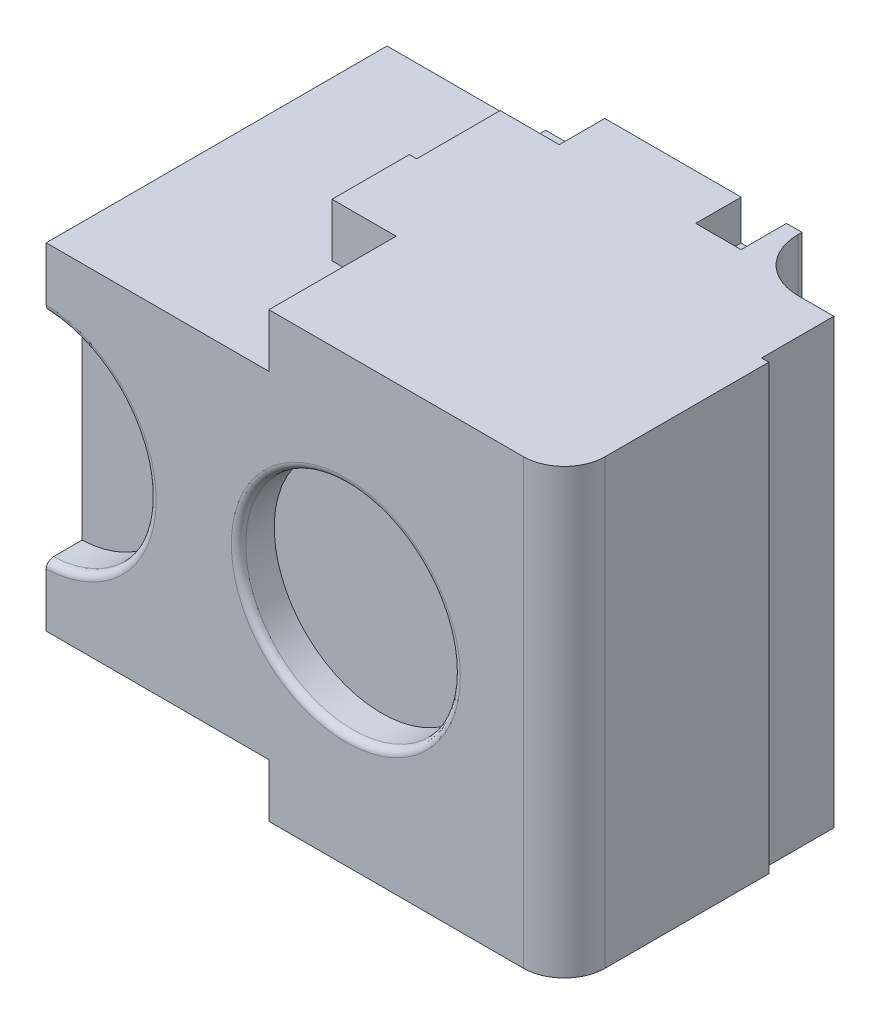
ISO-10303-21;
HEADER;
FILE_DESCRIPTION(('STEP AP214'),'2;1');
FILE_NAME('part.step','',(''),(''),'','','');
FILE_SCHEMA(('AUTOMOTIVE_DESIGN { 1 0 10303 214 1 1 1 1 }'));
ENDSEC;
DATA;
#1=APPLICATION_CONTEXT('core data for automotive mechanical design processes');
#2=APPLICATION_PROTOCOL_DEFINITION('international standard','automotive_design',2000,#1);
#3=PRODUCT_CONTEXT('',#1,'mechanical');
#4=PRODUCT('Part','Part','',(#3));
#5=PRODUCT_RELATED_PRODUCT_CATEGORY('part','',(#4));
#6=PRODUCT_DEFINITION_FORMATION('','',#4);
#7=PRODUCT_DEFINITION_CONTEXT('part definition',#1,'design');
#8=PRODUCT_DEFINITION('design','',#6,#7);
#9=PRODUCT_DEFINITION_SHAPE('','',#8);
#10=(LENGTH_UNIT() NAMED_UNIT(*) SI_UNIT(.MILLI.,.METRE.));
#11=(NAMED_UNIT(*) PLANE_ANGLE_UNIT() SI_UNIT($,.RADIAN.));
#12=(NAMED_UNIT(*) SI_UNIT($,.STERADIAN.) SOLID_ANGLE_UNIT());
#13=UNCERTAINTY_MEASURE_WITH_UNIT(LENGTH_MEASURE(1.E-05),#10,'distance_accuracy_value','');
#14=(GEOMETRIC_REPRESENTATION_CONTEXT(3) GLOBAL_UNCERTAINTY_ASSIGNED_CONTEXT((#13)) GLOBAL_UNIT_ASSIGNED_CONTEXT((#10,
#11,#12)) REPRESENTATION_CONTEXT('',''));
#15=CARTESIAN_POINT('',(0.,0.,0.));
#16=DIRECTION('',(0.,0.,1.));
#17=DIRECTION('',(1.,0.,0.));
#18=AXIS2_PLACEMENT_3D('',#15,#16,#17);
#19=CARTESIAN_POINT('',(114.935,50.8,52.832));
#20=DIRECTION('',(0.,-1.,0.));
#21=DIRECTION('',(0.,0.,-1.));
#22=AXIS2_PLACEMENT_3D('',#19,#20,#21);
#23=PLANE('',#22);
#24=DIRECTION('',(-1.,0.,0.));
#25=VECTOR('',#24,1.);
#26=CARTESIAN_POINT('',(0.,50.8,65.532));
#27=LINE('',#26,#25);
#28=CARTESIAN_POINT('',(114.935,50.8,65.532));
#29=VERTEX_POINT('',#28);
#30=CARTESIAN_POINT('',(102.235,50.8,65.532));
#31=VERTEX_POINT('',#30);
#32=EDGE_CURVE('E554',#29,#31,#27,.T.);
#33=ORIENTED_EDGE('',*,*,#32,.F.);
#34=DIRECTION('',(0.,0.,-1.));
#35=VECTOR('',#34,1.);
#36=CARTESIAN_POINT('',(114.935,50.8,52.832));
#37=LINE('',#36,#35);
#38=CARTESIAN_POINT('',(114.935,50.8,52.832));
#39=VERTEX_POINT('',#38);
#40=EDGE_CURVE('E560',#29,#39,#37,.T.);
#41=ORIENTED_EDGE('',*,*,#40,.T.);
#42=DIRECTION('',(1.,0.,0.));
#43=VECTOR('',#42,1.);
#44=CARTESIAN_POINT('',(45.593,50.8,52.832));
#45=LINE('',#44,#43);
#46=CARTESIAN_POINT('',(102.235,50.8,52.832));
#47=VERTEX_POINT('',#46);
#48=EDGE_CURVE('E427',#39,#47,#45,.F.);
#49=ORIENTED_EDGE('',*,*,#48,.T.);
#50=DIRECTION('',(0.,0.,1.));
#51=VECTOR('',#50,1.);
#52=CARTESIAN_POINT('',(102.235,50.8,52.832));
#53=LINE('',#52,#51);
#54=EDGE_CURVE('E552',#47,#31,#53,.T.);
#55=ORIENTED_EDGE('',*,*,#54,.T.);
#56=EDGE_LOOP('',(#33,#41,#49,#55));
#57=FACE_BOUND('',#56,.T.);
#58=ADVANCED_FACE('F35',(#57),#23,.F.);
#59=CARTESIAN_POINT('',(64.135,50.8,52.832));
#60=DIRECTION('',(0.,-1.,0.));
#61=DIRECTION('',(0.,0.,-1.));
#62=AXIS2_PLACEMENT_3D('',#59,#60,#61);
#63=PLANE('',#62);
#64=DIRECTION('',(0.,0.,-1.));
#65=VECTOR('',#64,1.);
#66=CARTESIAN_POINT('',(64.135,50.8,52.832));
#67=LINE('',#66,#65);
#68=CARTESIAN_POINT('',(64.135,50.8,65.532));
#69=VERTEX_POINT('',#68);
#70=CARTESIAN_POINT('',(64.135,50.8,52.832));
#71=VERTEX_POINT('',#70);
#72=EDGE_CURVE('E551',#69,#71,#67,.T.);
#73=ORIENTED_EDGE('',*,*,#72,.T.);
#74=DIRECTION('',(1.,0.,0.));
#75=VECTOR('',#74,1.);
#76=CARTESIAN_POINT('',(45.593,50.8,52.832));
#77=LINE('',#76,#75);
#78=CARTESIAN_POINT('',(47.625,50.8,52.832));
#79=VERTEX_POINT('',#78);
#80=EDGE_CURVE('E541',#71,#79,#77,.F.);
#81=ORIENTED_EDGE('',*,*,#80,.T.);
#82=DIRECTION('',(0.,0.,1.));
#83=VECTOR('',#82,1.);
#84=CARTESIAN_POINT('',(47.625,50.8,146.05));
#85=LINE('',#84,#83);
#86=CARTESIAN_POINT('',(47.625,50.8,65.532));
#87=VERTEX_POINT('',#86);
#88=EDGE_CURVE('E530',#87,#79,#85,.F.);
#89=ORIENTED_EDGE('',*,*,#88,.F.);
#90=DIRECTION('',(-1.,0.,0.));
#91=VECTOR('',#90,1.);
#92=CARTESIAN_POINT('',(0.,50.8,65.532));
#93=LINE('',#92,#91);
#94=EDGE_CURVE('E660',#69,#87,#93,.T.);
#95=ORIENTED_EDGE('',*,*,#94,.F.);
#96=EDGE_LOOP('',(#73,#81,#89,#95));
#97=FACE_BOUND('',#96,.T.);
#98=ADVANCED_FACE('F870',(#97),#63,.F.);
#99=CARTESIAN_POINT('',(119.253,-61.9125,50.8));
#100=DIRECTION('',(-1.,0.,0.));
#101=DIRECTION('',(0.,0.,1.));
#102=AXIS2_PLACEMENT_3D('',#99,#100,#101);
#103=PLANE('',#102);
#104=DIRECTION('',(0.,1.,0.));
#105=VECTOR('',#104,1.);
#106=CARTESIAN_POINT('',(119.253,-74.295,52.832));
#107=LINE('',#106,#105);
#108=CARTESIAN_POINT('',(119.253,-61.9125,52.832));
#109=VERTEX_POINT('',#108);
#110=CARTESIAN_POINT('',(119.253,61.9125,52.832));
#111=VERTEX_POINT('',#110);
#112=EDGE_CURVE('E432',#109,#111,#107,.T.);
#113=ORIENTED_EDGE('',*,*,#112,.T.);
#114=DIRECTION('',(0.,0.,1.));
#115=VECTOR('',#114,1.);
#116=CARTESIAN_POINT('',(119.253,61.9125,50.8));
#117=LINE('',#116,#115);
#118=CARTESIAN_POINT('',(119.253,61.9125,53.975));
#119=VERTEX_POINT('',#118);
#120=EDGE_CURVE('E608',#119,#111,#117,.F.);
#121=ORIENTED_EDGE('',*,*,#120,.F.);
#122=DIRECTION('',(0.,-1.,0.));
#123=VECTOR('',#122,1.);
#124=CARTESIAN_POINT('',(119.253,223.33077,53.975));
#125=LINE('',#124,#123);
#126=CARTESIAN_POINT('',(119.253,-61.9125,53.975));
#127=VERTEX_POINT('',#126);
#128=EDGE_CURVE('E420',#119,#127,#125,.T.);
#129=ORIENTED_EDGE('',*,*,#128,.T.);
#130=DIRECTION('',(0.,0.,1.));
#131=VECTOR('',#130,1.);
#132=CARTESIAN_POINT('',(119.253,-61.9125,50.8));
#133=LINE('',#132,#131);
#134=EDGE_CURVE('E562',#109,#127,#133,.T.);
#135=ORIENTED_EDGE('',*,*,#134,.F.);
#136=EDGE_LOOP('',(#113,#121,#129,#135));
#137=FACE_BOUND('',#136,.T.);
#138=ADVANCED_FACE('F866',(#137),#103,.F.);
#139=CARTESIAN_POINT('',(45.593,-50.8,52.832));
#140=DIRECTION('',(0.,1.,0.));
#141=DIRECTION('',(0.,0.,1.));
#142=AXIS2_PLACEMENT_3D('',#139,#140,#141);
#143=PLANE('',#142);
#144=DIRECTION('',(0.,0.,-1.));
#145=VECTOR('',#144,1.);
#146=CARTESIAN_POINT('',(114.935,-50.8,52.832));
#147=LINE('',#146,#145);
#148=CARTESIAN_POINT('',(114.935,-50.8,52.832));
#149=VERTEX_POINT('',#148);
#150=CARTESIAN_POINT('',(114.935,-50.8,65.532));
#151=VERTEX_POINT('',#150);
#152=EDGE_CURVE('E640',#149,#151,#147,.F.);
#153=ORIENTED_EDGE('',*,*,#152,.T.);
#154=DIRECTION('',(-1.,0.,0.));
#155=VECTOR('',#154,1.);
#156=CARTESIAN_POINT('',(0.,-50.8,65.532));
#157=LINE('',#156,#155);
#158=CARTESIAN_POINT('',(47.625,-50.8,65.532));
#159=VERTEX_POINT('',#158);
#160=EDGE_CURVE('E454',#159,#151,#157,.F.);
#161=ORIENTED_EDGE('',*,*,#160,.F.);
#162=DIRECTION('',(0.,0.,1.));
#163=VECTOR('',#162,1.);
#164=CARTESIAN_POINT('',(47.625,-50.8,146.05));
#165=LINE('',#164,#163);
#166=CARTESIAN_POINT('',(47.625,-50.8,52.832));
#167=VERTEX_POINT('',#166);
#168=EDGE_CURVE('E478',#167,#159,#165,.T.);
#169=ORIENTED_EDGE('',*,*,#168,.F.);
#170=DIRECTION('',(1.,0.,0.));
#171=VECTOR('',#170,1.);
#172=CARTESIAN_POINT('',(45.593,-50.8,52.832));
#173=LINE('',#172,#171);
#174=EDGE_CURVE('E584',#167,#149,#173,.T.);
#175=ORIENTED_EDGE('',*,*,#174,.T.);
#176=EDGE_LOOP('',(#153,#161,#169,#175));
#177=FACE_BOUND('',#176,.T.);
#178=ADVANCED_FACE('F862',(#177),#143,.F.);
#179=CARTESIAN_POINT('',(114.935,61.9125,52.832));
#180=DIRECTION('',(1.,0.,0.));
#181=DIRECTION('',(0.,0.,-1.));
#182=AXIS2_PLACEMENT_3D('',#179,#180,#181);
#183=PLANE('',#182);
#184=ORIENTED_EDGE('',*,*,#40,.F.);
#185=DIRECTION('',(0.,1.,0.));
#186=VECTOR('',#185,1.);
#187=CARTESIAN_POINT('',(114.935,-74.295,65.532));
#188=LINE('',#187,#186);
#189=CARTESIAN_POINT('',(114.935,61.9125,65.532));
#190=VERTEX_POINT('',#189);
#191=EDGE_CURVE('E557',#190,#29,#188,.F.);
#192=ORIENTED_EDGE('',*,*,#191,.F.);
#193=DIRECTION('',(0.,0.,1.));
#194=VECTOR('',#193,1.);
#195=CARTESIAN_POINT('',(114.935,61.9125,50.8));
#196=LINE('',#195,#194);
#197=CARTESIAN_POINT('',(114.935,61.9125,52.832));
#198=VERTEX_POINT('',#197);
#199=EDGE_CURVE('E357',#198,#190,#196,.T.);
#200=ORIENTED_EDGE('',*,*,#199,.F.);
#201=DIRECTION('',(0.,1.,0.));
#202=VECTOR('',#201,1.);
#203=CARTESIAN_POINT('',(114.935,-74.295,52.832));
#204=LINE('',#203,#202);
#205=EDGE_CURVE('E429',#198,#39,#204,.F.);
#206=ORIENTED_EDGE('',*,*,#205,.T.);
#207=EDGE_LOOP('',(#184,#192,#200,#206));
#208=FACE_BOUND('',#207,.T.);
#209=ADVANCED_FACE('F858',(#208),#183,.F.);
#210=CARTESIAN_POINT('',(0.,-74.295,65.532));
#211=DIRECTION('',(0.,0.,-1.));
#212=DIRECTION('',(-1.,0.,0.));
#213=AXIS2_PLACEMENT_3D('',#210,#211,#212);
#214=PLANE('',#213);
#215=DIRECTION('',(0.,1.,0.));
#216=VECTOR('',#215,1.);
#217=CARTESIAN_POINT('',(102.235,50.8,65.532));
#218=LINE('',#217,#216);
#219=CARTESIAN_POINT('',(102.235,61.9125,65.532));
#220=VERTEX_POINT('',#219);
#221=EDGE_CURVE('E549',#31,#220,#218,.T.);
#222=ORIENTED_EDGE('',*,*,#221,.T.);
#223=DIRECTION('',(1.,0.,0.));
#224=VECTOR('',#223,1.);
#225=CARTESIAN_POINT('',(146.05,61.9125,65.532));
#226=LINE('',#225,#224);
#227=EDGE_CURVE('E354',#190,#220,#226,.F.);
#228=ORIENTED_EDGE('',*,*,#227,.F.);
#229=ORIENTED_EDGE('',*,*,#191,.T.);
#230=ORIENTED_EDGE('',*,*,#32,.T.);
#231=EDGE_LOOP('',(#222,#228,#229,#230));
#232=FACE_BOUND('',#231,.T.);
#233=ADVANCED_FACE('F854',(#232),#214,.T.);
#234=CARTESIAN_POINT('',(102.235,50.8,52.832));
#235=DIRECTION('',(-1.,0.,0.));
#236=DIRECTION('',(0.,0.,1.));
#237=AXIS2_PLACEMENT_3D('',#234,#235,#236);
#238=PLANE('',#237);
#239=ORIENTED_EDGE('',*,*,#54,.F.);
#240=DIRECTION('',(0.,1.,0.));
#241=VECTOR('',#240,1.);
#242=CARTESIAN_POINT('',(102.235,-74.295,52.832));
#243=LINE('',#242,#241);
#244=CARTESIAN_POINT('',(102.235,61.9125,52.832));
#245=VERTEX_POINT('',#244);
#246=EDGE_CURVE('E424',#47,#245,#243,.T.);
#247=ORIENTED_EDGE('',*,*,#246,.T.);
#248=DIRECTION('',(0.,0.,1.));
#249=VECTOR('',#248,1.);
#250=CARTESIAN_POINT('',(102.235,61.9125,50.8));
#251=LINE('',#250,#249);
#252=EDGE_CURVE('E350',#220,#245,#251,.F.);
#253=ORIENTED_EDGE('',*,*,#252,.F.);
#254=ORIENTED_EDGE('',*,*,#221,.F.);
#255=EDGE_LOOP('',(#239,#247,#253,#254));
#256=FACE_BOUND('',#255,.T.);
#257=ADVANCED_FACE('F850',(#256),#238,.F.);
#258=CARTESIAN_POINT('',(64.135,61.9125,52.832));
#259=DIRECTION('',(1.,0.,0.));
#260=DIRECTION('',(0.,0.,-1.));
#261=AXIS2_PLACEMENT_3D('',#258,#259,#260);
#262=PLANE('',#261);
#263=ORIENTED_EDGE('',*,*,#72,.F.);
#264=DIRECTION('',(0.,1.,0.));
#265=VECTOR('',#264,1.);
#266=CARTESIAN_POINT('',(64.135,-74.295,65.532));
#267=LINE('',#266,#265);
#268=CARTESIAN_POINT('',(64.135,61.9125,65.532));
#269=VERTEX_POINT('',#268);
#270=EDGE_CURVE('E628',#269,#69,#267,.F.);
#271=ORIENTED_EDGE('',*,*,#270,.F.);
#272=DIRECTION('',(0.,0.,1.));
#273=VECTOR('',#272,1.);
#274=CARTESIAN_POINT('',(64.135,61.9125,50.8));
#275=LINE('',#274,#273);
#276=CARTESIAN_POINT('',(64.135,61.9125,52.832));
#277=VERTEX_POINT('',#276);
#278=EDGE_CURVE('E631',#277,#269,#275,.T.);
#279=ORIENTED_EDGE('',*,*,#278,.F.);
#280=DIRECTION('',(0.,1.,0.));
#281=VECTOR('',#280,1.);
#282=CARTESIAN_POINT('',(64.135,-74.295,52.832));
#283=LINE('',#282,#281);
#284=EDGE_CURVE('E426',#277,#71,#283,.F.);
#285=ORIENTED_EDGE('',*,*,#284,.T.);
#286=EDGE_LOOP('',(#263,#271,#279,#285));
#287=FACE_BOUND('',#286,.T.);
#288=ADVANCED_FACE('F846',(#287),#262,.F.);
#289=CARTESIAN_POINT('',(0.,-74.295,65.532));
#290=DIRECTION('',(0.,0.,-1.));
#291=DIRECTION('',(-1.,0.,0.));
#292=AXIS2_PLACEMENT_3D('',#289,#290,#291);
#293=PLANE('',#292);
#294=ORIENTED_EDGE('',*,*,#94,.T.);
#295=DIRECTION('',(0.,1.,0.));
#296=VECTOR('',#295,1.);
#297=CARTESIAN_POINT('',(47.625,0.,65.532));
#298=LINE('',#297,#296);
#299=CARTESIAN_POINT('',(47.625,61.9125,65.532));
#300=VERTEX_POINT('',#299);
#301=EDGE_CURVE('E617',#300,#87,#298,.F.);
#302=ORIENTED_EDGE('',*,*,#301,.F.);
#303=DIRECTION('',(1.,0.,0.));
#304=VECTOR('',#303,1.);
#305=CARTESIAN_POINT('',(146.05,61.9125,65.532));
#306=LINE('',#305,#304);
#307=EDGE_CURVE('E581',#269,#300,#306,.F.);
#308=ORIENTED_EDGE('',*,*,#307,.F.);
#309=ORIENTED_EDGE('',*,*,#270,.T.);
#310=EDGE_LOOP('',(#294,#302,#308,#309));
#311=FACE_BOUND('',#310,.T.);
#312=ADVANCED_FACE('F842',(#311),#293,.T.);
#313=CARTESIAN_POINT('',(47.625,0.,146.05));
#314=DIRECTION('',(-1.,0.,0.));
#315=DIRECTION('',(0.,0.,1.));
#316=AXIS2_PLACEMENT_3D('',#313,#314,#315);
#317=PLANE('',#316);
#318=DIRECTION('',(0.,1.,0.));
#319=VECTOR('',#318,1.);
#320=CARTESIAN_POINT('',(47.625,46.99,88.9));
#321=LINE('',#320,#319);
#322=CARTESIAN_POINT('',(47.625,46.99,88.9));
#323=VERTEX_POINT('',#322);
#324=CARTESIAN_POINT('',(47.625,61.9125,88.9));
#325=VERTEX_POINT('',#324);
#326=EDGE_CURVE('E522',#323,#325,#321,.T.);
#327=ORIENTED_EDGE('',*,*,#326,.T.);
#328=DIRECTION('',(0.,0.,1.));
#329=VECTOR('',#328,1.);
#330=CARTESIAN_POINT('',(47.625,61.9125,50.8));
#331=LINE('',#330,#329);
#332=EDGE_CURVE('E505',#300,#325,#331,.T.);
#333=ORIENTED_EDGE('',*,*,#332,.F.);
#334=ORIENTED_EDGE('',*,*,#301,.T.);
#335=ORIENTED_EDGE('',*,*,#88,.T.);
#336=DIRECTION('',(0.,1.,0.));
#337=VECTOR('',#336,1.);
#338=CARTESIAN_POINT('',(47.625,-74.295,52.832));
#339=LINE('',#338,#337);
#340=CARTESIAN_POINT('',(47.625,46.99,52.832));
#341=VERTEX_POINT('',#340);
#342=EDGE_CURVE('E468',#79,#341,#339,.F.);
#343=ORIENTED_EDGE('',*,*,#342,.T.);
#344=DIRECTION('',(0.,0.,-1.));
#345=VECTOR('',#344,1.);
#346=CARTESIAN_POINT('',(47.625,46.99,146.05));
#347=LINE('',#346,#345);
#348=EDGE_CURVE('E526',#341,#323,#347,.F.);
#349=ORIENTED_EDGE('',*,*,#348,.T.);
#350=EDGE_LOOP('',(#327,#333,#334,#335,#343,#349));
#351=FACE_BOUND('',#350,.T.);
#352=ADVANCED_FACE('F838',(#351),#317,.T.);
#353=CARTESIAN_POINT('',(45.593,46.99,88.9));
#354=DIRECTION('',(0.,0.,1.));
#355=DIRECTION('',(1.,0.,0.));
#356=AXIS2_PLACEMENT_3D('',#353,#354,#355);
#357=PLANE('',#356);
#358=DIRECTION('',(1.,0.,0.));
#359=VECTOR('',#358,1.);
#360=CARTESIAN_POINT('',(1.27,46.99,88.9));
#361=LINE('',#360,#359);
#362=CARTESIAN_POINT('',(45.593,46.99,88.9));
#363=VERTEX_POINT('',#362);
#364=EDGE_CURVE('E518',#323,#363,#361,.F.);
#365=ORIENTED_EDGE('',*,*,#364,.T.);
#366=DIRECTION('',(0.,1.,0.));
#367=VECTOR('',#366,1.);
#368=CARTESIAN_POINT('',(45.593,46.99,88.9));
#369=LINE('',#368,#367);
#370=CARTESIAN_POINT('',(45.593,61.9125,88.9));
#371=VERTEX_POINT('',#370);
#372=EDGE_CURVE('E514',#363,#371,#369,.T.);
#373=ORIENTED_EDGE('',*,*,#372,.T.);
#374=DIRECTION('',(1.,0.,0.));
#375=VECTOR('',#374,1.);
#376=CARTESIAN_POINT('',(146.05,61.9125,88.9));
#377=LINE('',#376,#375);
#378=EDGE_CURVE('E393',#325,#371,#377,.F.);
#379=ORIENTED_EDGE('',*,*,#378,.F.);
#380=ORIENTED_EDGE('',*,*,#326,.F.);
#381=EDGE_LOOP('',(#365,#373,#379,#380));
#382=FACE_BOUND('',#381,.T.);
#383=ADVANCED_FACE('F834',(#382),#357,.F.);
#384=CARTESIAN_POINT('',(45.593,46.99,146.05));
#385=DIRECTION('',(1.,0.,0.));
#386=DIRECTION('',(0.,0.,-1.));
#387=AXIS2_PLACEMENT_3D('',#384,#385,#386);
#388=PLANE('',#387);
#389=DIRECTION('',(0.,1.,0.));
#390=VECTOR('',#389,1.);
#391=CARTESIAN_POINT('',(45.593,0.,110.49));
#392=LINE('',#391,#390);
#393=CARTESIAN_POINT('',(45.593,61.9125,110.49));
#394=VERTEX_POINT('',#393);
#395=CARTESIAN_POINT('',(45.593,46.99,110.49));
#396=VERTEX_POINT('',#395);
#397=EDGE_CURVE('E455',#394,#396,#392,.F.);
#398=ORIENTED_EDGE('',*,*,#397,.F.);
#399=DIRECTION('',(0.,0.,1.));
#400=VECTOR('',#399,1.);
#401=CARTESIAN_POINT('',(45.593,61.9125,50.8));
#402=LINE('',#401,#400);
#403=EDGE_CURVE('E546',#371,#394,#402,.T.);
#404=ORIENTED_EDGE('',*,*,#403,.F.);
#405=ORIENTED_EDGE('',*,*,#372,.F.);
#406=DIRECTION('',(0.,0.,-1.));
#407=VECTOR('',#406,1.);
#408=CARTESIAN_POINT('',(45.593,46.99,146.05));
#409=LINE('',#408,#407);
#410=EDGE_CURVE('E509',#363,#396,#409,.F.);
#411=ORIENTED_EDGE('',*,*,#410,.T.);
#412=EDGE_LOOP('',(#398,#404,#405,#411));
#413=FACE_BOUND('',#412,.T.);
#414=ADVANCED_FACE('F830',(#413),#388,.F.);
#415=CARTESIAN_POINT('',(0.,0.,110.49));
#416=DIRECTION('',(0.,0.,1.));
#417=DIRECTION('',(1.,0.,0.));
#418=AXIS2_PLACEMENT_3D('',#415,#416,#417);
#419=PLANE('',#418);
#420=DIRECTION('',(0.,1.,0.));
#421=VECTOR('',#420,1.);
#422=CARTESIAN_POINT('',(63.5,46.99,110.49));
#423=LINE('',#422,#421);
#424=CARTESIAN_POINT('',(63.5,46.99,110.49));
#425=VERTEX_POINT('',#424);
#426=CARTESIAN_POINT('',(63.5,61.9125,110.49));
#427=VERTEX_POINT('',#426);
#428=EDGE_CURVE('E342',#425,#427,#423,.T.);
#429=ORIENTED_EDGE('',*,*,#428,.T.);
#430=DIRECTION('',(1.,0.,0.));
#431=VECTOR('',#430,1.);
#432=CARTESIAN_POINT('',(146.05,61.9125,110.49));
#433=LINE('',#432,#431);
#434=EDGE_CURVE('E371',#394,#427,#433,.T.);
#435=ORIENTED_EDGE('',*,*,#434,.F.);
#436=ORIENTED_EDGE('',*,*,#397,.T.);
#437=DIRECTION('',(1.,0.,0.));
#438=VECTOR('',#437,1.);
#439=CARTESIAN_POINT('',(1.27,46.99,110.49));
#440=LINE('',#439,#438);
#441=EDGE_CURVE('E331',#396,#425,#440,.T.);
#442=ORIENTED_EDGE('',*,*,#441,.T.);
#443=EDGE_LOOP('',(#429,#435,#436,#442));
#444=FACE_BOUND('',#443,.T.);
#445=ADVANCED_FACE('F826',(#444),#419,.T.);
#446=CARTESIAN_POINT('',(45.593,-74.295,50.8));
#447=DIRECTION('',(-1.,0.,0.));
#448=DIRECTION('',(0.,0.,1.));
#449=AXIS2_PLACEMENT_3D('',#446,#447,#448);
#450=PLANE('',#449);
#451=DIRECTION('',(0.,0.,-1.));
#452=VECTOR('',#451,1.);
#453=CARTESIAN_POINT('',(45.593,46.99,146.05));
#454=LINE('',#453,#452);
#455=CARTESIAN_POINT('',(45.593,46.99,50.8));
#456=VERTEX_POINT('',#455);
#457=CARTESIAN_POINT('',(45.593,46.99,52.832));
#458=VERTEX_POINT('',#457);
#459=EDGE_CURVE('E341',#456,#458,#454,.F.);
#460=ORIENTED_EDGE('',*,*,#459,.T.);
#461=DIRECTION('',(0.,1.,0.));
#462=VECTOR('',#461,1.);
#463=CARTESIAN_POINT('',(45.593,-74.295,52.832));
#464=LINE('',#463,#462);
#465=CARTESIAN_POINT('',(45.593,-46.99,52.832));
#466=VERTEX_POINT('',#465);
#467=EDGE_CURVE('E423',#458,#466,#464,.F.);
#468=ORIENTED_EDGE('',*,*,#467,.T.);
#469=DIRECTION('',(0.,0.,1.));
#470=VECTOR('',#469,1.);
#471=CARTESIAN_POINT('',(45.593,-46.99,146.05));
#472=LINE('',#471,#470);
#473=CARTESIAN_POINT('',(45.593,-46.99,50.8));
#474=VERTEX_POINT('',#473);
#475=EDGE_CURVE('E449',#466,#474,#472,.F.);
#476=ORIENTED_EDGE('',*,*,#475,.T.);
#477=DIRECTION('',(0.,1.,0.));
#478=VECTOR('',#477,1.);
#479=CARTESIAN_POINT('',(45.593,0.,50.8));
#480=LINE('',#479,#478);
#481=EDGE_CURVE('E452',#474,#456,#480,.T.);
#482=ORIENTED_EDGE('',*,*,#481,.T.);
#483=EDGE_LOOP('',(#460,#468,#476,#482));
#484=FACE_BOUND('',#483,.T.);
#485=ADVANCED_FACE('F822',(#484),#450,.F.);
#486=CARTESIAN_POINT('',(0.,0.,50.8));
#487=DIRECTION('',(0.,0.,1.));
#488=DIRECTION('',(1.,0.,0.));
#489=AXIS2_PLACEMENT_3D('',#486,#487,#488);
#490=PLANE('',#489);
#491=DIRECTION('',(0.,1.,0.));
#492=VECTOR('',#491,1.);
#493=CARTESIAN_POINT('',(1.27,61.9125,50.8));
#494=LINE('',#493,#492);
#495=CARTESIAN_POINT('',(1.27,46.99,50.8));
#496=VERTEX_POINT('',#495);
#497=CARTESIAN_POINT('',(1.27,-46.99,50.8));
#498=VERTEX_POINT('',#497);
#499=EDGE_CURVE('E320',#496,#498,#494,.F.);
#500=ORIENTED_EDGE('',*,*,#499,.F.);
#501=DIRECTION('',(1.,0.,0.));
#502=VECTOR('',#501,1.);
#503=CARTESIAN_POINT('',(1.27,46.99,50.8));
#504=LINE('',#503,#502);
#505=EDGE_CURVE('E321',#496,#456,#504,.T.);
#506=ORIENTED_EDGE('',*,*,#505,.T.);
#507=ORIENTED_EDGE('',*,*,#481,.F.);
#508=DIRECTION('',(1.,0.,0.));
#509=VECTOR('',#508,1.);
#510=CARTESIAN_POINT('',(45.593,-46.99,50.8));
#511=LINE('',#510,#509);
#512=EDGE_CURVE('E447',#474,#498,#511,.F.);
#513=ORIENTED_EDGE('',*,*,#512,.T.);
#514=EDGE_LOOP('',(#500,#506,#507,#513));
#515=FACE_BOUND('',#514,.T.);
#516=ADVANCED_FACE('F818',(#515),#490,.F.);
#517=CARTESIAN_POINT('',(0.,-74.295,65.532));
#518=DIRECTION('',(0.,0.,-1.));
#519=DIRECTION('',(-1.,0.,0.));
#520=AXIS2_PLACEMENT_3D('',#517,#518,#519);
#521=PLANE('',#520);
#522=DIRECTION('',(1.,0.,0.));
#523=VECTOR('',#522,1.);
#524=CARTESIAN_POINT('',(1.27,-61.9125,65.532));
#525=LINE('',#524,#523);
#526=CARTESIAN_POINT('',(47.625,-61.9125,65.532));
#527=VERTEX_POINT('',#526);
#528=CARTESIAN_POINT('',(114.935,-61.9125,65.532));
#529=VERTEX_POINT('',#528);
#530=EDGE_CURVE('E706',#527,#529,#525,.T.);
#531=ORIENTED_EDGE('',*,*,#530,.F.);
#532=DIRECTION('',(0.,1.,0.));
#533=VECTOR('',#532,1.);
#534=CARTESIAN_POINT('',(47.625,0.,65.532));
#535=LINE('',#534,#533);
#536=EDGE_CURVE('E394',#159,#527,#535,.F.);
#537=ORIENTED_EDGE('',*,*,#536,.F.);
#538=ORIENTED_EDGE('',*,*,#160,.T.);
#539=DIRECTION('',(0.,1.,0.));
#540=VECTOR('',#539,1.);
#541=CARTESIAN_POINT('',(114.935,-50.8,65.532));
#542=LINE('',#541,#540);
#543=EDGE_CURVE('E587',#151,#529,#542,.F.);
#544=ORIENTED_EDGE('',*,*,#543,.T.);
#545=EDGE_LOOP('',(#531,#537,#538,#544));
#546=FACE_BOUND('',#545,.T.);
#547=ADVANCED_FACE('F814',(#546),#521,.T.);
#548=CARTESIAN_POINT('',(114.935,-50.8,52.832));
#549=DIRECTION('',(1.,0.,0.));
#550=DIRECTION('',(0.,0.,-1.));
#551=AXIS2_PLACEMENT_3D('',#548,#549,#550);
#552=PLANE('',#551);
#553=ORIENTED_EDGE('',*,*,#152,.F.);
#554=DIRECTION('',(0.,1.,0.));
#555=VECTOR('',#554,1.);
#556=CARTESIAN_POINT('',(114.935,-74.295,52.832));
#557=LINE('',#556,#555);
#558=CARTESIAN_POINT('',(114.935,-61.9125,52.832));
#559=VERTEX_POINT('',#558);
#560=EDGE_CURVE('E586',#149,#559,#557,.F.);
#561=ORIENTED_EDGE('',*,*,#560,.T.);
#562=DIRECTION('',(0.,0.,-1.));
#563=VECTOR('',#562,1.);
#564=CARTESIAN_POINT('',(114.935,-61.9125,50.8));
#565=LINE('',#564,#563);
#566=EDGE_CURVE('E682',#529,#559,#565,.T.);
#567=ORIENTED_EDGE('',*,*,#566,.F.);
#568=ORIENTED_EDGE('',*,*,#543,.F.);
#569=EDGE_LOOP('',(#553,#561,#567,#568));
#570=FACE_BOUND('',#569,.T.);
#571=ADVANCED_FACE('F810',(#570),#552,.F.);
#572=CARTESIAN_POINT('',(45.593,-74.295,52.832));
#573=DIRECTION('',(0.,0.,1.));
#574=DIRECTION('',(1.,0.,0.));
#575=AXIS2_PLACEMENT_3D('',#572,#573,#574);
#576=PLANE('',#575);
#577=ORIENTED_EDGE('',*,*,#467,.F.);
#578=DIRECTION('',(1.,0.,0.));
#579=VECTOR('',#578,1.);
#580=CARTESIAN_POINT('',(1.27,46.99,52.832));
#581=LINE('',#580,#579);
#582=EDGE_CURVE('E501',#458,#341,#581,.T.);
#583=ORIENTED_EDGE('',*,*,#582,.T.);
#584=ORIENTED_EDGE('',*,*,#342,.F.);
#585=ORIENTED_EDGE('',*,*,#80,.F.);
#586=ORIENTED_EDGE('',*,*,#284,.F.);
#587=DIRECTION('',(1.,0.,0.));
#588=VECTOR('',#587,1.);
#589=CARTESIAN_POINT('',(146.05,61.9125,52.832));
#590=LINE('',#589,#588);
#591=EDGE_CURVE('E353',#245,#277,#590,.F.);
#592=ORIENTED_EDGE('',*,*,#591,.F.);
#593=ORIENTED_EDGE('',*,*,#246,.F.);
#594=ORIENTED_EDGE('',*,*,#48,.F.);
#595=ORIENTED_EDGE('',*,*,#205,.F.);
#596=DIRECTION('',(1.,0.,0.));
#597=VECTOR('',#596,1.);
#598=CARTESIAN_POINT('',(146.05,61.9125,52.832));
#599=LINE('',#598,#597);
#600=EDGE_CURVE('E360',#111,#198,#599,.F.);
#601=ORIENTED_EDGE('',*,*,#600,.F.);
#602=ORIENTED_EDGE('',*,*,#112,.F.);
#603=DIRECTION('',(1.,0.,0.));
#604=VECTOR('',#603,1.);
#605=CARTESIAN_POINT('',(1.27,-61.9125,52.832));
#606=LINE('',#605,#604);
#607=EDGE_CURVE('E678',#559,#109,#606,.T.);
#608=ORIENTED_EDGE('',*,*,#607,.F.);
#609=ORIENTED_EDGE('',*,*,#560,.F.);
#610=ORIENTED_EDGE('',*,*,#174,.F.);
#611=DIRECTION('',(0.,1.,0.));
#612=VECTOR('',#611,1.);
#613=CARTESIAN_POINT('',(47.625,0.,52.832));
#614=LINE('',#613,#612);
#615=CARTESIAN_POINT('',(47.625,-46.99,52.832));
#616=VERTEX_POINT('',#615);
#617=EDGE_CURVE('E475',#616,#167,#614,.F.);
#618=ORIENTED_EDGE('',*,*,#617,.F.);
#619=DIRECTION('',(1.,0.,0.));
#620=VECTOR('',#619,1.);
#621=CARTESIAN_POINT('',(45.593,-46.99,52.832));
#622=LINE('',#621,#620);
#623=EDGE_CURVE('E459',#616,#466,#622,.F.);
#624=ORIENTED_EDGE('',*,*,#623,.T.);
#625=EDGE_LOOP('',(#577,#583,#584,#585,#586,#592,#593,#594,#595,#601,#602,#608,#609,#610,#618,#624));
#626=FACE_BOUND('',#625,.T.);
#627=ADVANCED_FACE('F806',(#626),#576,.F.);
#628=CARTESIAN_POINT('',(133.985,223.33077,53.975));
#629=DIRECTION('',(0.,-1.,0.));
#630=DIRECTION('',(0.,0.,-1.));
#631=AXIS2_PLACEMENT_3D('',#628,#629,#630);
#632=CYLINDRICAL_SURFACE('',#631,14.732);
#633=ORIENTED_EDGE('',*,*,#128,.F.);
#634=CARTESIAN_POINT('',(133.985,61.9125,53.975));
#635=DIRECTION('',(0.,-1.,0.));
#636=DIRECTION('',(0.,0.,-1.));
#637=AXIS2_PLACEMENT_3D('',#634,#635,#636);
#638=CIRCLE('',#637,14.732);
#639=CARTESIAN_POINT('',(133.985,61.9125,68.707));
#640=VERTEX_POINT('',#639);
#641=EDGE_CURVE('E303',#640,#119,#638,.T.);
#642=ORIENTED_EDGE('',*,*,#641,.F.);
#643=DIRECTION('',(0.,1.,0.));
#644=VECTOR('',#643,1.);
#645=CARTESIAN_POINT('',(133.985,0.,68.707));
#646=LINE('',#645,#644);
#647=CARTESIAN_POINT('',(133.985,-61.9125,68.707));
#648=VERTEX_POINT('',#647);
#649=EDGE_CURVE('E416',#648,#640,#646,.T.);
#650=ORIENTED_EDGE('',*,*,#649,.F.);
#651=CARTESIAN_POINT('',(133.985,-61.9125,53.975));
#652=DIRECTION('',(0.,-1.,0.));
#653=DIRECTION('',(0.,0.,-1.));
#654=AXIS2_PLACEMENT_3D('',#651,#652,#653);
#655=CIRCLE('',#654,14.732);
#656=EDGE_CURVE('E681',#127,#648,#655,.F.);
#657=ORIENTED_EDGE('',*,*,#656,.F.);
#658=EDGE_LOOP('',(#633,#642,#650,#657));
#659=FACE_BOUND('',#658,.T.);
#660=ADVANCED_FACE('F802',(#659),#632,.F.);
#661=CARTESIAN_POINT('',(0.,0.,68.707));
#662=DIRECTION('',(0.,0.,-1.));
#663=DIRECTION('',(-1.,0.,0.));
#664=AXIS2_PLACEMENT_3D('',#661,#662,#663);
#665=PLANE('',#664);
#666=DIRECTION('',(1.,0.,0.));
#667=VECTOR('',#666,1.);
#668=CARTESIAN_POINT('',(1.27,-61.9125,68.707));
#669=LINE('',#668,#667);
#670=CARTESIAN_POINT('',(144.018,-61.9125,68.707));
#671=VERTEX_POINT('',#670);
#672=EDGE_CURVE('E412',#648,#671,#669,.T.);
#673=ORIENTED_EDGE('',*,*,#672,.F.);
#674=ORIENTED_EDGE('',*,*,#649,.T.);
#675=DIRECTION('',(1.,0.,0.));
#676=VECTOR('',#675,1.);
#677=CARTESIAN_POINT('',(146.05,61.9125,68.707));
#678=LINE('',#677,#676);
#679=CARTESIAN_POINT('',(144.018,61.9125,68.707));
#680=VERTEX_POINT('',#679);
#681=EDGE_CURVE('E361',#680,#640,#678,.F.);
#682=ORIENTED_EDGE('',*,*,#681,.F.);
#683=DIRECTION('',(0.,1.,0.));
#684=VECTOR('',#683,1.);
#685=CARTESIAN_POINT('',(144.018,-74.295,68.707));
#686=LINE('',#685,#684);
#687=EDGE_CURVE('E407',#680,#671,#686,.F.);
#688=ORIENTED_EDGE('',*,*,#687,.T.);
#689=EDGE_LOOP('',(#673,#674,#682,#688));
#690=FACE_BOUND('',#689,.T.);
#691=ADVANCED_FACE('F798',(#690),#665,.T.);
#692=CARTESIAN_POINT('',(144.018,-74.295,68.707));
#693=DIRECTION('',(-1.,0.,0.));
#694=DIRECTION('',(0.,0.,1.));
#695=AXIS2_PLACEMENT_3D('',#692,#693,#694);
#696=PLANE('',#695);
#697=DIRECTION('',(0.,0.,1.));
#698=VECTOR('',#697,1.);
#699=CARTESIAN_POINT('',(144.018,61.9125,50.8));
#700=LINE('',#699,#698);
#701=CARTESIAN_POINT('',(144.018,61.9125,88.9));
#702=VERTEX_POINT('',#701);
#703=EDGE_CURVE('E364',#702,#680,#700,.F.);
#704=ORIENTED_EDGE('',*,*,#703,.F.);
#705=DIRECTION('',(0.,1.,0.));
#706=VECTOR('',#705,1.);
#707=CARTESIAN_POINT('',(144.018,-74.295,88.9));
#708=LINE('',#707,#706);
#709=CARTESIAN_POINT('',(144.018,-61.9125,88.9));
#710=VERTEX_POINT('',#709);
#711=EDGE_CURVE('E404',#702,#710,#708,.F.);
#712=ORIENTED_EDGE('',*,*,#711,.T.);
#713=DIRECTION('',(0.,0.,-1.));
#714=VECTOR('',#713,1.);
#715=CARTESIAN_POINT('',(144.018,-61.9125,50.8));
#716=LINE('',#715,#714);
#717=EDGE_CURVE('E401',#671,#710,#716,.F.);
#718=ORIENTED_EDGE('',*,*,#717,.F.);
#719=ORIENTED_EDGE('',*,*,#687,.F.);
#720=EDGE_LOOP('',(#704,#712,#718,#719));
#721=FACE_BOUND('',#720,.T.);
#722=ADVANCED_FACE('F794',(#721),#696,.F.);
#723=CARTESIAN_POINT('',(144.018,-74.295,88.9));
#724=DIRECTION('',(0.,0.,1.));
#725=DIRECTION('',(1.,0.,0.));
#726=AXIS2_PLACEMENT_3D('',#723,#724,#725);
#727=PLANE('',#726);
#728=DIRECTION('',(1.,0.,0.));
#729=VECTOR('',#728,1.);
#730=CARTESIAN_POINT('',(146.05,61.9125,88.9));
#731=LINE('',#730,#729);
#732=CARTESIAN_POINT('',(146.05,61.9125,88.9));
#733=VERTEX_POINT('',#732);
#734=EDGE_CURVE('E370',#733,#702,#731,.F.);
#735=ORIENTED_EDGE('',*,*,#734,.F.);
#736=DIRECTION('',(0.,1.,0.));
#737=VECTOR('',#736,1.);
#738=CARTESIAN_POINT('',(146.05,-61.9125,88.9));
#739=LINE('',#738,#737);
#740=CARTESIAN_POINT('',(146.05,-61.9125,88.9));
#741=VERTEX_POINT('',#740);
#742=EDGE_CURVE('E391',#741,#733,#739,.T.);
#743=ORIENTED_EDGE('',*,*,#742,.F.);
#744=DIRECTION('',(1.,0.,0.));
#745=VECTOR('',#744,1.);
#746=CARTESIAN_POINT('',(1.27,-61.9125,88.9));
#747=LINE('',#746,#745);
#748=EDGE_CURVE('E397',#710,#741,#747,.T.);
#749=ORIENTED_EDGE('',*,*,#748,.F.);
#750=ORIENTED_EDGE('',*,*,#711,.F.);
#751=EDGE_LOOP('',(#735,#743,#749,#750));
#752=FACE_BOUND('',#751,.T.);
#753=ADVANCED_FACE('F790',(#752),#727,.F.);
#754=CARTESIAN_POINT('',(0.,0.,110.49));
#755=DIRECTION('',(0.,0.,1.));
#756=DIRECTION('',(1.,0.,0.));
#757=AXIS2_PLACEMENT_3D('',#754,#755,#756);
#758=PLANE('',#757);
#759=DIRECTION('',(0.,1.,0.));
#760=VECTOR('',#759,1.);
#761=CARTESIAN_POINT('',(45.593,-61.9125,110.49));
#762=LINE('',#761,#760);
#763=CARTESIAN_POINT('',(45.593,-46.99,110.49));
#764=VERTEX_POINT('',#763);
#765=CARTESIAN_POINT('',(45.593,-61.9125,110.49));
#766=VERTEX_POINT('',#765);
#767=EDGE_CURVE('E406',#764,#766,#762,.F.);
#768=ORIENTED_EDGE('',*,*,#767,.T.);
#769=DIRECTION('',(1.,0.,0.));
#770=VECTOR('',#769,1.);
#771=CARTESIAN_POINT('',(1.27,-61.9125,110.49));
#772=LINE('',#771,#770);
#773=CARTESIAN_POINT('',(63.5,-61.9125,110.49));
#774=VERTEX_POINT('',#773);
#775=EDGE_CURVE('E384',#774,#766,#772,.F.);
#776=ORIENTED_EDGE('',*,*,#775,.F.);
#777=DIRECTION('',(0.,1.,0.));
#778=VECTOR('',#777,1.);
#779=CARTESIAN_POINT('',(63.5,-61.9125,110.49));
#780=LINE('',#779,#778);
#781=CARTESIAN_POINT('',(63.5,-46.99,110.49));
#782=VERTEX_POINT('',#781);
#783=EDGE_CURVE('E378',#774,#782,#780,.T.);
#784=ORIENTED_EDGE('',*,*,#783,.T.);
#785=DIRECTION('',(1.,0.,0.));
#786=VECTOR('',#785,1.);
#787=CARTESIAN_POINT('',(45.593,-46.99,110.49));
#788=LINE('',#787,#786);
#789=EDGE_CURVE('E381',#782,#764,#788,.F.);
#790=ORIENTED_EDGE('',*,*,#789,.T.);
#791=EDGE_LOOP('',(#768,#776,#784,#790));
#792=FACE_BOUND('',#791,.T.);
#793=ADVANCED_FACE('F786',(#792),#758,.T.);
#794=CARTESIAN_POINT('',(45.593,-61.9125,146.05));
#795=DIRECTION('',(1.,0.,0.));
#796=DIRECTION('',(0.,0.,-1.));
#797=AXIS2_PLACEMENT_3D('',#794,#795,#796);
#798=PLANE('',#797);
#799=ORIENTED_EDGE('',*,*,#767,.F.);
#800=DIRECTION('',(0.,0.,1.));
#801=VECTOR('',#800,1.);
#802=CARTESIAN_POINT('',(45.593,-46.99,146.05));
#803=LINE('',#802,#801);
#804=CARTESIAN_POINT('',(45.593,-46.99,88.9));
#805=VERTEX_POINT('',#804);
#806=EDGE_CURVE('E438',#764,#805,#803,.F.);
#807=ORIENTED_EDGE('',*,*,#806,.T.);
#808=DIRECTION('',(0.,1.,0.));
#809=VECTOR('',#808,1.);
#810=CARTESIAN_POINT('',(45.593,-61.9125,88.9));
#811=LINE('',#810,#809);
#812=CARTESIAN_POINT('',(45.593,-61.9125,88.9));
#813=VERTEX_POINT('',#812);
#814=EDGE_CURVE('E484',#805,#813,#811,.F.);
#815=ORIENTED_EDGE('',*,*,#814,.T.);
#816=DIRECTION('',(0.,0.,-1.));
#817=VECTOR('',#816,1.);
#818=CARTESIAN_POINT('',(45.593,-61.9125,50.8));
#819=LINE('',#818,#817);
#820=EDGE_CURVE('E387',#766,#813,#819,.T.);
#821=ORIENTED_EDGE('',*,*,#820,.F.);
#822=EDGE_LOOP('',(#799,#807,#815,#821));
#823=FACE_BOUND('',#822,.T.);
#824=ADVANCED_FACE('F782',(#823),#798,.F.);
#825=CARTESIAN_POINT('',(45.593,-61.9125,88.9));
#826=DIRECTION('',(0.,0.,1.));
#827=DIRECTION('',(1.,0.,0.));
#828=AXIS2_PLACEMENT_3D('',#825,#826,#827);
#829=PLANE('',#828);
#830=DIRECTION('',(1.,0.,0.));
#831=VECTOR('',#830,1.);
#832=CARTESIAN_POINT('',(45.593,-46.99,88.9));
#833=LINE('',#832,#831);
#834=CARTESIAN_POINT('',(47.625,-46.99,88.9));
#835=VERTEX_POINT('',#834);
#836=EDGE_CURVE('E440',#805,#835,#833,.T.);
#837=ORIENTED_EDGE('',*,*,#836,.T.);
#838=DIRECTION('',(0.,1.,0.));
#839=VECTOR('',#838,1.);
#840=CARTESIAN_POINT('',(47.625,0.,88.9));
#841=LINE('',#840,#839);
#842=CARTESIAN_POINT('',(47.625,-61.9125,88.9));
#843=VERTEX_POINT('',#842);
#844=EDGE_CURVE('E479',#843,#835,#841,.T.);
#845=ORIENTED_EDGE('',*,*,#844,.F.);
#846=DIRECTION('',(1.,0.,0.));
#847=VECTOR('',#846,1.);
#848=CARTESIAN_POINT('',(1.27,-61.9125,88.9));
#849=LINE('',#848,#847);
#850=EDGE_CURVE('E597',#813,#843,#849,.T.);
#851=ORIENTED_EDGE('',*,*,#850,.F.);
#852=ORIENTED_EDGE('',*,*,#814,.F.);
#853=EDGE_LOOP('',(#837,#845,#851,#852));
#854=FACE_BOUND('',#853,.T.);
#855=ADVANCED_FACE('F778',(#854),#829,.F.);
#856=CARTESIAN_POINT('',(47.625,0.,146.05));
#857=DIRECTION('',(-1.,0.,0.));
#858=DIRECTION('',(0.,0.,1.));
#859=AXIS2_PLACEMENT_3D('',#856,#857,#858);
#860=PLANE('',#859);
#861=ORIENTED_EDGE('',*,*,#536,.T.);
#862=DIRECTION('',(0.,0.,-1.));
#863=VECTOR('',#862,1.);
#864=CARTESIAN_POINT('',(47.625,-61.9125,50.8));
#865=LINE('',#864,#863);
#866=EDGE_CURVE('E594',#843,#527,#865,.T.);
#867=ORIENTED_EDGE('',*,*,#866,.F.);
#868=ORIENTED_EDGE('',*,*,#844,.T.);
#869=DIRECTION('',(0.,0.,1.));
#870=VECTOR('',#869,1.);
#871=CARTESIAN_POINT('',(47.625,-46.99,146.05));
#872=LINE('',#871,#870);
#873=EDGE_CURVE('E464',#835,#616,#872,.F.);
#874=ORIENTED_EDGE('',*,*,#873,.T.);
#875=ORIENTED_EDGE('',*,*,#617,.T.);
#876=ORIENTED_EDGE('',*,*,#168,.T.);
#877=EDGE_LOOP('',(#861,#867,#868,#874,#875,#876));
#878=FACE_BOUND('',#877,.T.);
#879=ADVANCED_FACE('F774',(#878),#860,.T.);
#880=CARTESIAN_POINT('',(146.05,-61.9125,50.8));
#881=DIRECTION('',(1.,0.,0.));
#882=DIRECTION('',(0.,0.,-1.));
#883=AXIS2_PLACEMENT_3D('',#880,#881,#882);
#884=PLANE('',#883);
#885=DIRECTION('',(0.,0.,-1.));
#886=VECTOR('',#885,1.);
#887=CARTESIAN_POINT('',(146.05,-61.9125,50.8));
#888=LINE('',#887,#886);
#889=CARTESIAN_POINT('',(146.05,-61.9125,134.62));
#890=VERTEX_POINT('',#889);
#891=EDGE_CURVE('E400',#741,#890,#888,.F.);
#892=ORIENTED_EDGE('',*,*,#891,.F.);
#893=ORIENTED_EDGE('',*,*,#742,.T.);
#894=DIRECTION('',(0.,0.,1.));
#895=VECTOR('',#894,1.);
#896=CARTESIAN_POINT('',(146.05,61.9125,50.8));
#897=LINE('',#896,#895);
#898=CARTESIAN_POINT('',(146.05,61.9125,134.62));
#899=VERTEX_POINT('',#898);
#900=EDGE_CURVE('E367',#899,#733,#897,.F.);
#901=ORIENTED_EDGE('',*,*,#900,.F.);
#902=DIRECTION('',(0.,1.,0.));
#903=VECTOR('',#902,1.);
#904=CARTESIAN_POINT('',(146.05,-223.33077,134.62));
#905=LINE('',#904,#903);
#906=EDGE_CURVE('E374',#890,#899,#905,.T.);
#907=ORIENTED_EDGE('',*,*,#906,.F.);
#908=EDGE_LOOP('',(#892,#893,#901,#907));
#909=FACE_BOUND('',#908,.T.);
#910=ADVANCED_FACE('F770',(#909),#884,.T.);
#911=CARTESIAN_POINT('',(146.05,61.9125,50.8));
#912=DIRECTION('',(0.,1.,0.));
#913=DIRECTION('',(0.,0.,1.));
#914=AXIS2_PLACEMENT_3D('',#911,#912,#913);
#915=PLANE('',#914);
#916=ORIENTED_EDGE('',*,*,#307,.T.);
#917=ORIENTED_EDGE('',*,*,#332,.T.);
#918=ORIENTED_EDGE('',*,*,#378,.T.);
#919=ORIENTED_EDGE('',*,*,#403,.T.);
#920=ORIENTED_EDGE('',*,*,#434,.T.);
#921=DIRECTION('',(0.,0.,-1.));
#922=VECTOR('',#921,1.);
#923=CARTESIAN_POINT('',(63.5,61.9125,146.05));
#924=LINE('',#923,#922);
#925=CARTESIAN_POINT('',(63.5,61.9125,146.05));
#926=VERTEX_POINT('',#925);
#927=EDGE_CURVE('E339',#427,#926,#924,.F.);
#928=ORIENTED_EDGE('',*,*,#927,.T.);
#929=DIRECTION('',(1.,0.,0.));
#930=VECTOR('',#929,1.);
#931=CARTESIAN_POINT('',(0.,61.9125,146.05));
#932=LINE('',#931,#930);
#933=CARTESIAN_POINT('',(134.62,61.9125,146.05));
#934=VERTEX_POINT('',#933);
#935=EDGE_CURVE('E336',#934,#926,#932,.F.);
#936=ORIENTED_EDGE('',*,*,#935,.F.);
#937=CARTESIAN_POINT('',(134.62,61.9125,134.62));
#938=DIRECTION('',(0.,1.,0.));
#939=DIRECTION('',(0.,0.,1.));
#940=AXIS2_PLACEMENT_3D('',#937,#938,#939);
#941=CIRCLE('',#940,11.43);
#942=EDGE_CURVE('E347',#899,#934,#941,.F.);
#943=ORIENTED_EDGE('',*,*,#942,.F.);
#944=ORIENTED_EDGE('',*,*,#900,.T.);
#945=ORIENTED_EDGE('',*,*,#734,.T.);
#946=ORIENTED_EDGE('',*,*,#703,.T.);
#947=ORIENTED_EDGE('',*,*,#681,.T.);
#948=ORIENTED_EDGE('',*,*,#641,.T.);
#949=ORIENTED_EDGE('',*,*,#120,.T.);
#950=ORIENTED_EDGE('',*,*,#600,.T.);
#951=ORIENTED_EDGE('',*,*,#199,.T.);
#952=ORIENTED_EDGE('',*,*,#227,.T.);
#953=ORIENTED_EDGE('',*,*,#252,.T.);
#954=ORIENTED_EDGE('',*,*,#591,.T.);
#955=ORIENTED_EDGE('',*,*,#278,.T.);
#956=EDGE_LOOP('',(#916,#917,#918,#919,#920,#928,#936,#943,#944,#945,#946,#947,#948,#949,#950,
#951,#952,#953,#954,#955));
#957=FACE_BOUND('',#956,.T.);
#958=ADVANCED_FACE('F766',(#957),#915,.T.);
#959=CARTESIAN_POINT('',(63.5,46.99,146.05));
#960=DIRECTION('',(1.,0.,0.));
#961=DIRECTION('',(0.,0.,-1.));
#962=AXIS2_PLACEMENT_3D('',#959,#960,#961);
#963=PLANE('',#962);
#964=ORIENTED_EDGE('',*,*,#428,.F.);
#965=DIRECTION('',(0.,0.,-1.));
#966=VECTOR('',#965,1.);
#967=CARTESIAN_POINT('',(63.5,46.99,146.05));
#968=LINE('',#967,#966);
#969=CARTESIAN_POINT('',(63.5,46.99,146.05));
#970=VERTEX_POINT('',#969);
#971=EDGE_CURVE('E329',#425,#970,#968,.F.);
#972=ORIENTED_EDGE('',*,*,#971,.T.);
#973=DIRECTION('',(0.,1.,0.));
#974=VECTOR('',#973,1.);
#975=CARTESIAN_POINT('',(63.5,0.,146.05));
#976=LINE('',#975,#974);
#977=EDGE_CURVE('E326',#926,#970,#976,.F.);
#978=ORIENTED_EDGE('',*,*,#977,.F.);
#979=ORIENTED_EDGE('',*,*,#927,.F.);
#980=EDGE_LOOP('',(#964,#972,#978,#979));
#981=FACE_BOUND('',#980,.T.);
#982=ADVANCED_FACE('F762',(#981),#963,.F.);
#983=CARTESIAN_POINT('',(1.27,46.99,146.05));
#984=DIRECTION('',(0.,-1.,0.));
#985=DIRECTION('',(0.,0.,-1.));
#986=AXIS2_PLACEMENT_3D('',#983,#984,#985);
#987=PLANE('',#986);
#988=DIRECTION('',(0.,0.,1.));
#989=VECTOR('',#988,1.);
#990=CARTESIAN_POINT('',(1.27,46.99,50.8));
#991=LINE('',#990,#989);
#992=CARTESIAN_POINT('',(1.27,46.99,146.05));
#993=VERTEX_POINT('',#992);
#994=EDGE_CURVE('E316',#993,#496,#991,.F.);
#995=ORIENTED_EDGE('',*,*,#994,.F.);
#996=DIRECTION('',(1.,0.,0.));
#997=VECTOR('',#996,1.);
#998=CARTESIAN_POINT('',(0.,46.99,146.05));
#999=LINE('',#998,#997);
#1000=EDGE_CURVE('E310',#970,#993,#999,.F.);
#1001=ORIENTED_EDGE('',*,*,#1000,.F.);
#1002=ORIENTED_EDGE('',*,*,#971,.F.);
#1003=ORIENTED_EDGE('',*,*,#441,.F.);
#1004=ORIENTED_EDGE('',*,*,#410,.F.);
#1005=ORIENTED_EDGE('',*,*,#364,.F.);
#1006=ORIENTED_EDGE('',*,*,#348,.F.);
#1007=ORIENTED_EDGE('',*,*,#582,.F.);
#1008=ORIENTED_EDGE('',*,*,#459,.F.);
#1009=ORIENTED_EDGE('',*,*,#505,.F.);
#1010=EDGE_LOOP('',(#995,#1001,#1002,#1003,#1004,#1005,#1006,#1007,#1008,#1009));
#1011=FACE_BOUND('',#1010,.T.);
#1012=ADVANCED_FACE('F757',(#1011),#987,.F.);
#1013=CARTESIAN_POINT('',(1.27,61.9125,50.8));
#1014=DIRECTION('',(-1.,0.,0.));
#1015=DIRECTION('',(0.,0.,1.));
#1016=AXIS2_PLACEMENT_3D('',#1013,#1014,#1015);
#1017=PLANE('',#1016);
#1018=DIRECTION('',(0.,0.,1.));
#1019=VECTOR('',#1018,1.);
#1020=CARTESIAN_POINT('',(1.27,29.973106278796,136.05));
#1021=LINE('',#1020,#1019);
#1022=CARTESIAN_POINT('',(1.27,29.973106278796,144.05));
#1023=VERTEX_POINT('',#1022);
#1024=CARTESIAN_POINT('',(1.27,29.973106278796,136.05));
#1025=VERTEX_POINT('',#1024);
#1026=EDGE_CURVE('E279',#1023,#1025,#1021,.F.);
#1027=ORIENTED_EDGE('',*,*,#1026,.F.);
#1028=CARTESIAN_POINT('',(1.27,29.973106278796,144.05));
#1029=CARTESIAN_POINT('',(1.27,29.9731066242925,144.106233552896));
#1030=CARTESIAN_POINT('',(1.27,29.9754815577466,144.162440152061));
#1031=CARTESIAN_POINT('',(1.27,29.9849559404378,144.274450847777));
#1032=CARTESIAN_POINT('',(1.27,29.9920551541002,144.330254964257));
#1033=CARTESIAN_POINT('',(1.27,30.0203709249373,144.496363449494));
#1034=CARTESIAN_POINT('',(1.27,30.0486058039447,144.605554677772));
#1035=CARTESIAN_POINT('',(1.27,30.1230037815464,144.817643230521));
#1036=CARTESIAN_POINT('',(1.27,30.1691753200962,144.920537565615));
#1037=CARTESIAN_POINT('',(1.27,30.2781259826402,145.117116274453));
#1038=CARTESIAN_POINT('',(1.27,30.3409023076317,145.210802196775));
#1039=CARTESIAN_POINT('',(1.27,30.481305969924,145.386348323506));
#1040=CARTESIAN_POINT('',(1.27,30.5589392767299,145.468203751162));
#1041=CARTESIAN_POINT('',(1.27,30.7268543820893,145.617749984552));
#1042=CARTESIAN_POINT('',(1.27,30.817138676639,145.685437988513));
#1043=CARTESIAN_POINT('',(1.27,31.0078670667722,145.804775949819));
#1044=CARTESIAN_POINT('',(1.27,31.1083215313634,145.85640931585));
#1045=CARTESIAN_POINT('',(1.27,31.3164494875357,145.942065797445));
#1046=CARTESIAN_POINT('',(1.27,31.4241187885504,145.976099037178));
#1047=CARTESIAN_POINT('',(1.27,31.6061629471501,146.017189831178));
#1048=CARTESIAN_POINT('',(1.27,31.6793983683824,146.029486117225));
#1049=CARTESIAN_POINT('',(1.27,31.8266751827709,146.045890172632));
#1050=CARTESIAN_POINT('',(1.27,31.9007152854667,146.050009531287));
#1051=CARTESIAN_POINT('',(1.27,31.9747885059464,146.05));
#1052=B_SPLINE_CURVE_WITH_KNOTS('',3,(#1028,#1029,#1030,#1031,#1032,#1033,#1034,#1035,#1036,
#1037,#1038,#1039,#1040,#1041,#1042,#1043,#1044,#1045,#1046,#1047,#1048,#1049,#1050,#1051),
.UNSPECIFIED.,.F.,.F.,(4,2,2,2,2,2,2,2,2,2,2,4),(0.,0.168596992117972,0.337185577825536,
0.67379786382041,1.01056873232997,1.34728286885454,1.68413258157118,2.02104884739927,
2.35831214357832,2.69538121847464,2.9177373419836,3.13977809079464),.UNSPECIFIED.);
#1053=CARTESIAN_POINT('',(1.27,31.9747885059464,146.05));
#1054=VERTEX_POINT('',#1053);
#1055=EDGE_CURVE('E11',#1023,#1054,#1052,.T.);
#1056=ORIENTED_EDGE('',*,*,#1055,.T.);
#1057=DIRECTION('',(0.,1.,0.));
#1058=VECTOR('',#1057,1.);
#1059=CARTESIAN_POINT('',(1.27,0.,146.05));
#1060=LINE('',#1059,#1058);
#1061=EDGE_CURVE('E309',#993,#1054,#1060,.F.);
#1062=ORIENTED_EDGE('',*,*,#1061,.F.);
#1063=ORIENTED_EDGE('',*,*,#994,.T.);
#1064=ORIENTED_EDGE('',*,*,#499,.T.);
#1065=DIRECTION('',(0.,0.,1.));
#1066=VECTOR('',#1065,1.);
#1067=CARTESIAN_POINT('',(1.27,-46.99,146.05));
#1068=LINE('',#1067,#1066);
#1069=CARTESIAN_POINT('',(1.27,-46.99,146.05));
#1070=VERTEX_POINT('',#1069);
#1071=EDGE_CURVE('E435',#498,#1070,#1068,.T.);
#1072=ORIENTED_EDGE('',*,*,#1071,.T.);
#1073=CARTESIAN_POINT('',(1.27,-31.9747885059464,146.05));
#1074=VERTEX_POINT('',#1073);
#1075=EDGE_CURVE('E306',#1074,#1070,#1060,.F.);
#1076=ORIENTED_EDGE('',*,*,#1075,.F.);
#1077=CARTESIAN_POINT('',(1.27,-31.9747885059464,146.05));
#1078=CARTESIAN_POINT('',(1.27,-31.9184385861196,146.049999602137));
#1079=CARTESIAN_POINT('',(1.27,-31.8621156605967,146.047620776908));
#1080=CARTESIAN_POINT('',(1.27,-31.7498726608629,146.038130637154));
#1081=CARTESIAN_POINT('',(1.27,-31.6939525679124,146.031019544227));
#1082=CARTESIAN_POINT('',(1.27,-31.527492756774,146.002654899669));
#1083=CARTESIAN_POINT('',(1.27,-31.4180677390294,145.974369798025));
#1084=CARTESIAN_POINT('',(1.27,-31.2055220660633,145.89983023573));
#1085=CARTESIAN_POINT('',(1.27,-31.102404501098,145.85356704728));
#1086=CARTESIAN_POINT('',(1.27,-30.905406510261,145.74438511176));
#1087=CARTESIAN_POINT('',(1.27,-30.8115244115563,145.681469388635));
#1088=CARTESIAN_POINT('',(1.27,-30.6356956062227,145.540785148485));
#1089=CARTESIAN_POINT('',(1.27,-30.5537450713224,145.463021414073));
#1090=CARTESIAN_POINT('',(1.27,-30.4040573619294,145.294811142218));
#1091=CARTESIAN_POINT('',(1.27,-30.3363229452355,145.204362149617));
#1092=CARTESIAN_POINT('',(1.27,-30.2170596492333,145.013431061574));
#1093=CARTESIAN_POINT('',(1.27,-30.1655213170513,144.91295486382));
#1094=CARTESIAN_POINT('',(1.27,-30.0800872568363,144.70479133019));
#1095=CARTESIAN_POINT('',(1.27,-30.0461809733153,144.597108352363));
#1096=CARTESIAN_POINT('',(1.27,-30.0054622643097,144.415630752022));
#1097=CARTESIAN_POINT('',(1.27,-29.9933361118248,144.342984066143));
#1098=CARTESIAN_POINT('',(1.27,-29.9771592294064,144.196901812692));
#1099=CARTESIAN_POINT('',(1.27,-29.9730970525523,144.123467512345));
#1100=CARTESIAN_POINT('',(1.27,-29.973106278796,144.05));
#1101=B_SPLINE_CURVE_WITH_KNOTS('',3,(#1077,#1078,#1079,#1080,#1081,#1082,#1083,#1084,#1085,
#1086,#1087,#1088,#1089,#1090,#1091,#1092,#1093,#1094,#1095,#1096,#1097,#1098,#1099,#1100),
.UNSPECIFIED.,.F.,.F.,(4,2,2,2,2,2,2,2,2,2,2,4),(0.,0.168945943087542,0.337883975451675,
0.675209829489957,1.01269964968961,1.35012822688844,1.68744829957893,2.02483374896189,
2.36202191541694,2.69900798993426,2.91954692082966,3.13977256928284),.UNSPECIFIED.);
#1102=CARTESIAN_POINT('',(1.27,-29.973106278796,144.05));
#1103=VERTEX_POINT('',#1102);
#1104=EDGE_CURVE('E48',#1074,#1103,#1101,.T.);
#1105=ORIENTED_EDGE('',*,*,#1104,.T.);
#1106=DIRECTION('',(0.,0.,1.));
#1107=VECTOR('',#1106,1.);
#1108=CARTESIAN_POINT('',(1.27,-29.973106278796,136.05));
#1109=LINE('',#1108,#1107);
#1110=CARTESIAN_POINT('',(1.27,-29.973106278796,136.05));
#1111=VERTEX_POINT('',#1110);
#1112=EDGE_CURVE('E285',#1111,#1103,#1109,.T.);
#1113=ORIENTED_EDGE('',*,*,#1112,.F.);
#1114=DIRECTION('',(0.,1.,0.));
#1115=VECTOR('',#1114,1.);
#1116=CARTESIAN_POINT('',(1.27,61.9125,136.05));
#1117=LINE('',#1116,#1115);
#1118=EDGE_CURVE('E289',#1111,#1025,#1117,.T.);
#1119=ORIENTED_EDGE('',*,*,#1118,.T.);
#1120=EDGE_LOOP('',(#1027,#1056,#1062,#1063,#1064,#1072,#1076,#1105,#1113,#1119));
#1121=FACE_BOUND('',#1120,.T.);
#1122=ADVANCED_FACE('F292',(#1121),#1017,.T.);
#1123=CARTESIAN_POINT('',(45.593,-46.99,146.05));
#1124=DIRECTION('',(0.,1.,0.));
#1125=DIRECTION('',(0.,0.,1.));
#1126=AXIS2_PLACEMENT_3D('',#1123,#1124,#1125);
#1127=PLANE('',#1126);
#1128=DIRECTION('',(0.,0.,-1.));
#1129=VECTOR('',#1128,1.);
#1130=CARTESIAN_POINT('',(63.5,-46.99,146.05));
#1131=LINE('',#1130,#1129);
#1132=CARTESIAN_POINT('',(63.5,-46.99,146.05));
#1133=VERTEX_POINT('',#1132);
#1134=EDGE_CURVE('E380',#782,#1133,#1131,.F.);
#1135=ORIENTED_EDGE('',*,*,#1134,.T.);
#1136=DIRECTION('',(1.,0.,0.));
#1137=VECTOR('',#1136,1.);
#1138=CARTESIAN_POINT('',(0.,-46.99,146.05));
#1139=LINE('',#1138,#1137);
#1140=EDGE_CURVE('E720',#1070,#1133,#1139,.T.);
#1141=ORIENTED_EDGE('',*,*,#1140,.F.);
#1142=ORIENTED_EDGE('',*,*,#1071,.F.);
#1143=ORIENTED_EDGE('',*,*,#512,.F.);
#1144=ORIENTED_EDGE('',*,*,#475,.F.);
#1145=ORIENTED_EDGE('',*,*,#623,.F.);
#1146=ORIENTED_EDGE('',*,*,#873,.F.);
#1147=ORIENTED_EDGE('',*,*,#836,.F.);
#1148=ORIENTED_EDGE('',*,*,#806,.F.);
#1149=ORIENTED_EDGE('',*,*,#789,.F.);
#1150=EDGE_LOOP('',(#1135,#1141,#1142,#1143,#1144,#1145,#1146,#1147,#1148,#1149));
#1151=FACE_BOUND('',#1150,.T.);
#1152=ADVANCED_FACE('F737',(#1151),#1127,.F.);
#1153=CARTESIAN_POINT('',(63.5,-61.9125,146.05));
#1154=DIRECTION('',(1.,0.,0.));
#1155=DIRECTION('',(0.,0.,-1.));
#1156=AXIS2_PLACEMENT_3D('',#1153,#1154,#1155);
#1157=PLANE('',#1156);
#1158=ORIENTED_EDGE('',*,*,#783,.F.);
#1159=DIRECTION('',(0.,0.,-1.));
#1160=VECTOR('',#1159,1.);
#1161=CARTESIAN_POINT('',(63.5,-61.9125,50.8));
#1162=LINE('',#1161,#1160);
#1163=CARTESIAN_POINT('',(63.5,-61.9125,146.05));
#1164=VERTEX_POINT('',#1163);
#1165=EDGE_CURVE('E388',#1164,#774,#1162,.T.);
#1166=ORIENTED_EDGE('',*,*,#1165,.F.);
#1167=DIRECTION('',(0.,1.,0.));
#1168=VECTOR('',#1167,1.);
#1169=CARTESIAN_POINT('',(63.5,0.,146.05));
#1170=LINE('',#1169,#1168);
#1171=EDGE_CURVE('E711',#1133,#1164,#1170,.F.);
#1172=ORIENTED_EDGE('',*,*,#1171,.F.);
#1173=ORIENTED_EDGE('',*,*,#1134,.F.);
#1174=EDGE_LOOP('',(#1158,#1166,#1172,#1173));
#1175=FACE_BOUND('',#1174,.T.);
#1176=ADVANCED_FACE('F903',(#1175),#1157,.F.);
#1177=CARTESIAN_POINT('',(1.27,-61.9125,50.8));
#1178=DIRECTION('',(0.,-1.,0.));
#1179=DIRECTION('',(0.,0.,-1.));
#1180=AXIS2_PLACEMENT_3D('',#1177,#1178,#1179);
#1181=PLANE('',#1180);
#1182=ORIENTED_EDGE('',*,*,#850,.T.);
#1183=ORIENTED_EDGE('',*,*,#866,.T.);
#1184=ORIENTED_EDGE('',*,*,#530,.T.);
#1185=ORIENTED_EDGE('',*,*,#566,.T.);
#1186=ORIENTED_EDGE('',*,*,#607,.T.);
#1187=ORIENTED_EDGE('',*,*,#134,.T.);
#1188=ORIENTED_EDGE('',*,*,#656,.T.);
#1189=ORIENTED_EDGE('',*,*,#672,.T.);
#1190=ORIENTED_EDGE('',*,*,#717,.T.);
#1191=ORIENTED_EDGE('',*,*,#748,.T.);
#1192=ORIENTED_EDGE('',*,*,#891,.T.);
#1193=CARTESIAN_POINT('',(134.62,-61.9125,134.62));
#1194=DIRECTION('',(0.,1.,0.));
#1195=DIRECTION('',(0.,0.,1.));
#1196=AXIS2_PLACEMENT_3D('',#1193,#1194,#1195);
#1197=CIRCLE('',#1196,11.43);
#1198=CARTESIAN_POINT('',(134.62,-61.9125,146.05));
#1199=VERTEX_POINT('',#1198);
#1200=EDGE_CURVE('E377',#1199,#890,#1197,.T.);
#1201=ORIENTED_EDGE('',*,*,#1200,.F.);
#1202=DIRECTION('',(1.,0.,0.));
#1203=VECTOR('',#1202,1.);
#1204=CARTESIAN_POINT('',(0.,-61.9125,146.05));
#1205=LINE('',#1204,#1203);
#1206=EDGE_CURVE('E300',#1164,#1199,#1205,.T.);
#1207=ORIENTED_EDGE('',*,*,#1206,.F.);
#1208=ORIENTED_EDGE('',*,*,#1165,.T.);
#1209=ORIENTED_EDGE('',*,*,#775,.T.);
#1210=ORIENTED_EDGE('',*,*,#820,.T.);
#1211=EDGE_LOOP('',(#1182,#1183,#1184,#1185,#1186,#1187,#1188,#1189,#1190,#1191,#1192,#1201,
#1207,#1208,#1209,#1210));
#1212=FACE_BOUND('',#1211,.T.);
#1213=ADVANCED_FACE('F897',(#1212),#1181,.T.);
#1214=CARTESIAN_POINT('',(134.62,-223.33077,134.62));
#1215=DIRECTION('',(0.,1.,0.));
#1216=DIRECTION('',(0.,0.,1.));
#1217=AXIS2_PLACEMENT_3D('',#1214,#1215,#1216);
#1218=CYLINDRICAL_SURFACE('',#1217,11.43);
#1219=ORIENTED_EDGE('',*,*,#906,.T.);
#1220=ORIENTED_EDGE('',*,*,#942,.T.);
#1221=DIRECTION('',(0.,1.,0.));
#1222=VECTOR('',#1221,1.);
#1223=CARTESIAN_POINT('',(134.62,0.,146.05));
#1224=LINE('',#1223,#1222);
#1225=EDGE_CURVE('E294',#1199,#934,#1224,.T.);
#1226=ORIENTED_EDGE('',*,*,#1225,.F.);
#1227=ORIENTED_EDGE('',*,*,#1200,.T.);
#1228=EDGE_LOOP('',(#1219,#1220,#1226,#1227));
#1229=FACE_BOUND('',#1228,.T.);
#1230=ADVANCED_FACE('F888',(#1229),#1218,.T.);
#1231=CARTESIAN_POINT('',(0.,0.,146.05));
#1232=DIRECTION('',(0.,0.,1.));
#1233=DIRECTION('',(1.,0.,0.));
#1234=AXIS2_PLACEMENT_3D('',#1231,#1232,#1233);
#1235=PLANE('',#1234);
#1236=CARTESIAN_POINT('',(85.,0.,146.05));
#1237=DIRECTION('',(0.,0.,1.));
#1238=DIRECTION('',(1.,0.,0.));
#1239=AXIS2_PLACEMENT_3D('',#1236,#1237,#1238);
#1240=CIRCLE('',#1239,32.);
#1241=CARTESIAN_POINT('',(117.,0.,146.05));
#1242=VERTEX_POINT('',#1241);
#1243=EDGE_CURVE('E745',#1242,#1242,#1240,.F.);
#1244=ORIENTED_EDGE('',*,*,#1243,.T.);
#1245=EDGE_LOOP('',(#1244));
#1246=FACE_BOUND('',#1245,.T.);
#1247=ORIENTED_EDGE('',*,*,#1061,.T.);
#1248=CARTESIAN_POINT('',(0.,0.,146.05));
#1249=DIRECTION('',(0.,0.,1.));
#1250=DIRECTION('',(1.,0.,0.));
#1251=AXIS2_PLACEMENT_3D('',#1248,#1249,#1250);
#1252=CIRCLE('',#1251,32.);
#1253=EDGE_CURVE('E297',#1054,#1074,#1252,.F.);
#1254=ORIENTED_EDGE('',*,*,#1253,.T.);
#1255=ORIENTED_EDGE('',*,*,#1075,.T.);
#1256=ORIENTED_EDGE('',*,*,#1140,.T.);
#1257=ORIENTED_EDGE('',*,*,#1171,.T.);
#1258=ORIENTED_EDGE('',*,*,#1206,.T.);
#1259=ORIENTED_EDGE('',*,*,#1225,.T.);
#1260=ORIENTED_EDGE('',*,*,#935,.T.);
#1261=ORIENTED_EDGE('',*,*,#977,.T.);
#1262=ORIENTED_EDGE('',*,*,#1000,.T.);
#1263=EDGE_LOOP('',(#1247,#1254,#1255,#1256,#1257,#1258,#1259,#1260,#1261,#1262));
#1264=FACE_BOUND('',#1263,.T.);
#1265=ADVANCED_FACE('F743',(#1246,#1264),#1235,.T.);
#1266=CARTESIAN_POINT('',(85.,0.,136.05));
#1267=DIRECTION('',(0.,0.,1.));
#1268=DIRECTION('',(1.,0.,0.));
#1269=AXIS2_PLACEMENT_3D('',#1266,#1267,#1268);
#1270=CYLINDRICAL_SURFACE('',#1269,30.);
#1271=CARTESIAN_POINT('',(85.,0.,144.05));
#1272=DIRECTION('',(0.,0.,1.));
#1273=DIRECTION('',(1.,0.,0.));
#1274=AXIS2_PLACEMENT_3D('',#1271,#1272,#1273);
#1275=CIRCLE('',#1274,30.);
#1276=CARTESIAN_POINT('',(115.,0.,144.05));
#1277=VERTEX_POINT('',#1276);
#1278=EDGE_CURVE('E293',#1277,#1277,#1275,.T.);
#1279=ORIENTED_EDGE('',*,*,#1278,.T.);
#1280=EDGE_LOOP('',(#1279));
#1281=FACE_BOUND('',#1280,.T.);
#1282=CARTESIAN_POINT('',(85.,0.,136.05));
#1283=DIRECTION('',(0.,0.,1.));
#1284=DIRECTION('',(1.,0.,0.));
#1285=AXIS2_PLACEMENT_3D('',#1282,#1283,#1284);
#1286=CIRCLE('',#1285,30.);
#1287=CARTESIAN_POINT('',(115.,0.,136.05));
#1288=VERTEX_POINT('',#1287);
#1289=EDGE_CURVE('E290',#1288,#1288,#1286,.T.);
#1290=ORIENTED_EDGE('',*,*,#1289,.F.);
#1291=EDGE_LOOP('',(#1290));
#1292=FACE_BOUND('',#1291,.T.);
#1293=ADVANCED_FACE('F877',(#1281,#1292),#1270,.F.);
#1294=CARTESIAN_POINT('',(85.,0.,136.05));
#1295=DIRECTION('',(0.,0.,1.));
#1296=DIRECTION('',(1.,0.,0.));
#1297=AXIS2_PLACEMENT_3D('',#1294,#1295,#1296);
#1298=PLANE('',#1297);
#1299=ORIENTED_EDGE('',*,*,#1289,.T.);
#1300=EDGE_LOOP('',(#1299));
#1301=FACE_BOUND('',#1300,.T.);
#1302=ADVANCED_FACE('F893',(#1301),#1298,.T.);
#1303=CARTESIAN_POINT('',(0.,0.,136.05));
#1304=DIRECTION('',(0.,0.,1.));
#1305=DIRECTION('',(1.,0.,0.));
#1306=AXIS2_PLACEMENT_3D('',#1303,#1304,#1305);
#1307=CYLINDRICAL_SURFACE('',#1306,30.);
#1308=ORIENTED_EDGE('',*,*,#1112,.T.);
#1309=CARTESIAN_POINT('',(0.,0.,144.05));
#1310=DIRECTION('',(0.,0.,1.));
#1311=DIRECTION('',(1.,0.,0.));
#1312=AXIS2_PLACEMENT_3D('',#1309,#1310,#1311);
#1313=CIRCLE('',#1312,30.);
#1314=EDGE_CURVE('E283',#1103,#1023,#1313,.T.);
#1315=ORIENTED_EDGE('',*,*,#1314,.T.);
#1316=ORIENTED_EDGE('',*,*,#1026,.T.);
#1317=CARTESIAN_POINT('',(0.,0.,136.05));
#1318=DIRECTION('',(0.,0.,1.));
#1319=DIRECTION('',(1.,0.,0.));
#1320=AXIS2_PLACEMENT_3D('',#1317,#1318,#1319);
#1321=CIRCLE('',#1320,30.);
#1322=EDGE_CURVE('E282',#1111,#1025,#1321,.T.);
#1323=ORIENTED_EDGE('',*,*,#1322,.F.);
#1324=EDGE_LOOP('',(#1308,#1315,#1316,#1323));
#1325=FACE_BOUND('',#1324,.T.);
#1326=ADVANCED_FACE('F281',(#1325),#1307,.F.);
#1327=CARTESIAN_POINT('',(0.,0.,136.05));
#1328=DIRECTION('',(0.,0.,1.));
#1329=DIRECTION('',(1.,0.,0.));
#1330=AXIS2_PLACEMENT_3D('',#1327,#1328,#1329);
#1331=PLANE('',#1330);
#1332=ORIENTED_EDGE('',*,*,#1322,.T.);
#1333=ORIENTED_EDGE('',*,*,#1118,.F.);
#1334=EDGE_LOOP('',(#1332,#1333));
#1335=FACE_BOUND('',#1334,.T.);
#1336=ADVANCED_FACE('F288',(#1335),#1331,.T.);
#1337=CARTESIAN_POINT('',(85.,0.,144.05));
#1338=DIRECTION('',(0.,0.,1.));
#1339=DIRECTION('',(1.,0.,0.));
#1340=AXIS2_PLACEMENT_3D('',#1337,#1338,#1339);
#1341=TOROIDAL_SURFACE('',#1340,32.,2.);
#1342=ORIENTED_EDGE('',*,*,#1243,.F.);
#1343=EDGE_LOOP('',(#1342));
#1344=FACE_BOUND('',#1343,.T.);
#1345=ORIENTED_EDGE('',*,*,#1278,.F.);
#1346=EDGE_LOOP('',(#1345));
#1347=FACE_BOUND('',#1346,.T.);
#1348=ADVANCED_FACE('F878',(#1344,#1347),#1341,.T.);
#1349=CARTESIAN_POINT('',(0.,0.,144.05));
#1350=DIRECTION('',(0.,0.,1.));
#1351=DIRECTION('',(1.,0.,0.));
#1352=AXIS2_PLACEMENT_3D('',#1349,#1350,#1351);
#1353=TOROIDAL_SURFACE('',#1352,32.,2.);
#1354=ORIENTED_EDGE('',*,*,#1104,.F.);
#1355=ORIENTED_EDGE('',*,*,#1253,.F.);
#1356=ORIENTED_EDGE('',*,*,#1055,.F.);
#1357=ORIENTED_EDGE('',*,*,#1314,.F.);
#1358=EDGE_LOOP('',(#1354,#1355,#1356,#1357));
#1359=FACE_BOUND('',#1358,.T.);
#1360=ADVANCED_FACE('F37',(#1359),#1353,.T.);
#1361=CLOSED_SHELL('',(#58,#98,#138,#178,#209,#233,#257,#288,#312,#352,#383,#414,#445,#485,#516,
#547,#571,#627,#660,#691,#722,#753,#793,#824,#855,#879,#910,#958,#982,#1012,#1122,#1152,#1176,
#1213,#1230,#1265,#1293,#1302,#1326,#1336,#1348,#1360));
#1362=MANIFOLD_SOLID_BREP('B2',#1361);
#1363=ADVANCED_BREP_SHAPE_REPRESENTATION('',(#18,#1362),#14);
#1364=SHAPE_DEFINITION_REPRESENTATION(#9,#1363);
ENDSEC;
END-ISO-10303-21;
